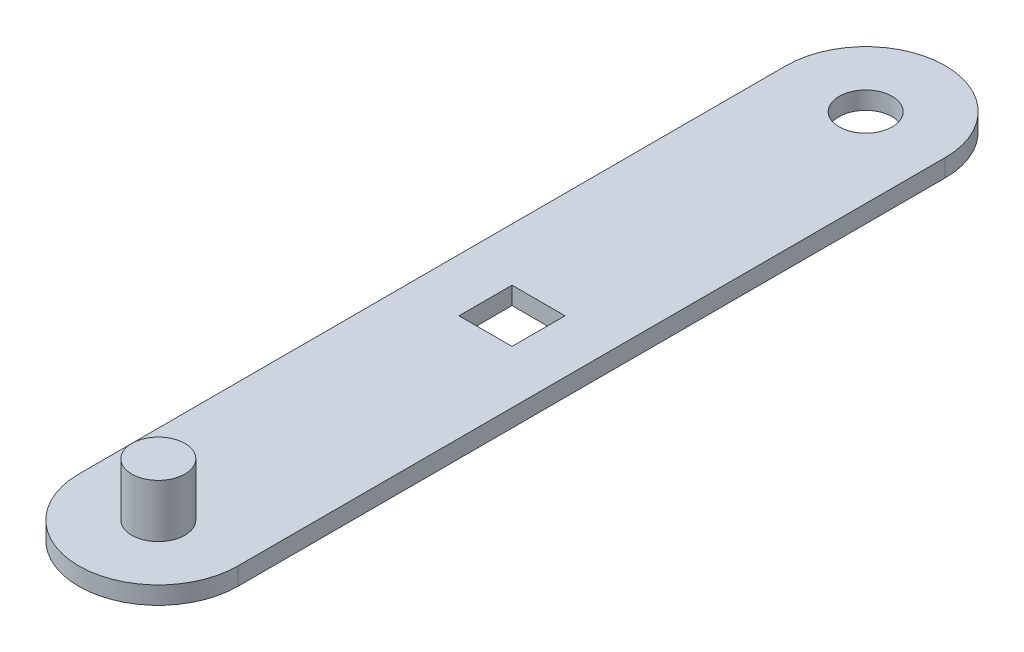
ISO-10303-21;
HEADER;
FILE_DESCRIPTION(('STEP AP214'),'2;1');
FILE_NAME('part.step','',(''),(''),'','','');
FILE_SCHEMA(('AUTOMOTIVE_DESIGN { 1 0 10303 214 1 1 1 1 }'));
ENDSEC;
DATA;
#1=APPLICATION_CONTEXT('core data for automotive mechanical design processes');
#2=APPLICATION_PROTOCOL_DEFINITION('international standard','automotive_design',2000,#1);
#3=PRODUCT_CONTEXT('',#1,'mechanical');
#4=PRODUCT('Part','Part','',(#3));
#5=PRODUCT_RELATED_PRODUCT_CATEGORY('part','',(#4));
#6=PRODUCT_DEFINITION_FORMATION('','',#4);
#7=PRODUCT_DEFINITION_CONTEXT('part definition',#1,'design');
#8=PRODUCT_DEFINITION('design','',#6,#7);
#9=PRODUCT_DEFINITION_SHAPE('','',#8);
#10=(LENGTH_UNIT() NAMED_UNIT(*) SI_UNIT(.MILLI.,.METRE.));
#11=(NAMED_UNIT(*) PLANE_ANGLE_UNIT() SI_UNIT($,.RADIAN.));
#12=(NAMED_UNIT(*) SI_UNIT($,.STERADIAN.) SOLID_ANGLE_UNIT());
#13=UNCERTAINTY_MEASURE_WITH_UNIT(LENGTH_MEASURE(1.E-05),#10,'distance_accuracy_value','');
#14=(GEOMETRIC_REPRESENTATION_CONTEXT(3) GLOBAL_UNCERTAINTY_ASSIGNED_CONTEXT((#13)) GLOBAL_UNIT_ASSIGNED_CONTEXT((#10,
#11,#12)) REPRESENTATION_CONTEXT('',''));
#15=CARTESIAN_POINT('',(0.,0.,0.));
#16=DIRECTION('',(0.,0.,1.));
#17=DIRECTION('',(1.,0.,0.));
#18=AXIS2_PLACEMENT_3D('',#15,#16,#17);
#19=CARTESIAN_POINT('',(-225.,50.,0.));
#20=DIRECTION('',(-1.,0.,0.));
#21=DIRECTION('',(0.,0.,1.));
#22=AXIS2_PLACEMENT_3D('',#19,#20,#21);
#23=PLANE('',#22);
#24=DIRECTION('',(0.,0.,-1.));
#25=VECTOR('',#24,1.);
#26=CARTESIAN_POINT('',(-225.,0.,0.));
#27=LINE('',#26,#25);
#28=CARTESIAN_POINT('',(-225.,0.,1000.));
#29=VERTEX_POINT('',#28);
#30=CARTESIAN_POINT('',(-225.,0.,-1000.));
#31=VERTEX_POINT('',#30);
#32=EDGE_CURVE('E146',#29,#31,#27,.T.);
#33=ORIENTED_EDGE('',*,*,#32,.F.);
#34=DIRECTION('',(0.,-1.,0.));
#35=VECTOR('',#34,1.);
#36=CARTESIAN_POINT('',(-225.,50.,1000.));
#37=LINE('',#36,#35);
#38=CARTESIAN_POINT('',(-225.,50.,1000.));
#39=VERTEX_POINT('',#38);
#40=EDGE_CURVE('E11',#39,#29,#37,.T.);
#41=ORIENTED_EDGE('',*,*,#40,.F.);
#42=DIRECTION('',(0.,0.,-1.));
#43=VECTOR('',#42,1.);
#44=CARTESIAN_POINT('',(-225.,50.,0.));
#45=LINE('',#44,#43);
#46=CARTESIAN_POINT('',(-225.,50.,-1000.));
#47=VERTEX_POINT('',#46);
#48=EDGE_CURVE('E150',#39,#47,#45,.T.);
#49=ORIENTED_EDGE('',*,*,#48,.T.);
#50=DIRECTION('',(0.,-1.,0.));
#51=VECTOR('',#50,1.);
#52=CARTESIAN_POINT('',(-225.,50.,-1000.));
#53=LINE('',#52,#51);
#54=EDGE_CURVE('E161',#47,#31,#53,.T.);
#55=ORIENTED_EDGE('',*,*,#54,.T.);
#56=EDGE_LOOP('',(#33,#41,#49,#55));
#57=FACE_BOUND('',#56,.T.);
#58=ADVANCED_FACE('F40',(#57),#23,.T.);
#59=CARTESIAN_POINT('',(0.,50.,1000.));
#60=DIRECTION('',(0.,-1.,0.));
#61=DIRECTION('',(0.,0.,-1.));
#62=AXIS2_PLACEMENT_3D('',#59,#60,#61);
#63=CYLINDRICAL_SURFACE('',#62,225.);
#64=CARTESIAN_POINT('',(0.,0.,1000.));
#65=DIRECTION('',(0.,1.,0.));
#66=DIRECTION('',(0.,0.,1.));
#67=AXIS2_PLACEMENT_3D('',#64,#65,#66);
#68=CIRCLE('',#67,225.);
#69=CARTESIAN_POINT('',(225.,0.,1000.));
#70=VERTEX_POINT('',#69);
#71=EDGE_CURVE('E164',#70,#29,#68,.F.);
#72=ORIENTED_EDGE('',*,*,#71,.F.);
#73=DIRECTION('',(0.,-1.,0.));
#74=VECTOR('',#73,1.);
#75=CARTESIAN_POINT('',(225.,50.,1000.));
#76=LINE('',#75,#74);
#77=CARTESIAN_POINT('',(225.,50.,1000.));
#78=VERTEX_POINT('',#77);
#79=EDGE_CURVE('E48',#78,#70,#76,.T.);
#80=ORIENTED_EDGE('',*,*,#79,.F.);
#81=CARTESIAN_POINT('',(0.,50.,1000.));
#82=DIRECTION('',(0.,1.,0.));
#83=DIRECTION('',(0.,0.,1.));
#84=AXIS2_PLACEMENT_3D('',#81,#82,#83);
#85=CIRCLE('',#84,225.);
#86=EDGE_CURVE('E153',#78,#39,#85,.F.);
#87=ORIENTED_EDGE('',*,*,#86,.T.);
#88=ORIENTED_EDGE('',*,*,#40,.T.);
#89=EDGE_LOOP('',(#72,#80,#87,#88));
#90=FACE_BOUND('',#89,.T.);
#91=ADVANCED_FACE('F185',(#90),#63,.T.);
#92=CARTESIAN_POINT('',(225.,50.,0.));
#93=DIRECTION('',(-1.,0.,0.));
#94=DIRECTION('',(0.,0.,1.));
#95=AXIS2_PLACEMENT_3D('',#92,#93,#94);
#96=PLANE('',#95);
#97=DIRECTION('',(0.,0.,-1.));
#98=VECTOR('',#97,1.);
#99=CARTESIAN_POINT('',(225.,0.,0.));
#100=LINE('',#99,#98);
#101=CARTESIAN_POINT('',(225.,0.,-1000.));
#102=VERTEX_POINT('',#101);
#103=EDGE_CURVE('E167',#70,#102,#100,.T.);
#104=ORIENTED_EDGE('',*,*,#103,.T.);
#105=DIRECTION('',(0.,-1.,0.));
#106=VECTOR('',#105,1.);
#107=CARTESIAN_POINT('',(225.,50.,-1000.));
#108=LINE('',#107,#106);
#109=CARTESIAN_POINT('',(225.,50.,-1000.));
#110=VERTEX_POINT('',#109);
#111=EDGE_CURVE('E172',#110,#102,#108,.T.);
#112=ORIENTED_EDGE('',*,*,#111,.F.);
#113=DIRECTION('',(0.,0.,-1.));
#114=VECTOR('',#113,1.);
#115=CARTESIAN_POINT('',(225.,50.,0.));
#116=LINE('',#115,#114);
#117=EDGE_CURVE('E157',#78,#110,#116,.T.);
#118=ORIENTED_EDGE('',*,*,#117,.F.);
#119=ORIENTED_EDGE('',*,*,#79,.T.);
#120=EDGE_LOOP('',(#104,#112,#118,#119));
#121=FACE_BOUND('',#120,.T.);
#122=ADVANCED_FACE('F178',(#121),#96,.F.);
#123=CARTESIAN_POINT('',(0.,50.,-1000.));
#124=DIRECTION('',(0.,-1.,0.));
#125=DIRECTION('',(0.,0.,-1.));
#126=AXIS2_PLACEMENT_3D('',#123,#124,#125);
#127=CYLINDRICAL_SURFACE('',#126,225.);
#128=CARTESIAN_POINT('',(0.,0.,-1000.));
#129=DIRECTION('',(0.,1.,0.));
#130=DIRECTION('',(0.,0.,1.));
#131=AXIS2_PLACEMENT_3D('',#128,#129,#130);
#132=CIRCLE('',#131,225.);
#133=EDGE_CURVE('E154',#102,#31,#132,.T.);
#134=ORIENTED_EDGE('',*,*,#133,.T.);
#135=ORIENTED_EDGE('',*,*,#54,.F.);
#136=CARTESIAN_POINT('',(0.,50.,-1000.));
#137=DIRECTION('',(0.,1.,0.));
#138=DIRECTION('',(0.,0.,1.));
#139=AXIS2_PLACEMENT_3D('',#136,#137,#138);
#140=CIRCLE('',#139,225.);
#141=EDGE_CURVE('E159',#110,#47,#140,.T.);
#142=ORIENTED_EDGE('',*,*,#141,.F.);
#143=ORIENTED_EDGE('',*,*,#111,.T.);
#144=EDGE_LOOP('',(#134,#135,#142,#143));
#145=FACE_BOUND('',#144,.T.);
#146=ADVANCED_FACE('F192',(#145),#127,.T.);
#147=CARTESIAN_POINT('',(0.,50.,0.));
#148=DIRECTION('',(0.,1.,0.));
#149=DIRECTION('',(0.,0.,1.));
#150=AXIS2_PLACEMENT_3D('',#147,#148,#149);
#151=PLANE('',#150);
#152=DIRECTION('',(0.,0.,-1.));
#153=VECTOR('',#152,1.);
#154=CARTESIAN_POINT('',(75.,50.,75.));
#155=LINE('',#154,#153);
#156=CARTESIAN_POINT('',(75.,50.,75.));
#157=VERTEX_POINT('',#156);
#158=CARTESIAN_POINT('',(75.,50.,-75.));
#159=VERTEX_POINT('',#158);
#160=EDGE_CURVE('E55',#157,#159,#155,.T.);
#161=ORIENTED_EDGE('',*,*,#160,.F.);
#162=DIRECTION('',(1.,0.,0.));
#163=VECTOR('',#162,1.);
#164=CARTESIAN_POINT('',(-75.,50.,75.));
#165=LINE('',#164,#163);
#166=CARTESIAN_POINT('',(-75.,50.,75.));
#167=VERTEX_POINT('',#166);
#168=EDGE_CURVE('E122',#167,#157,#165,.T.);
#169=ORIENTED_EDGE('',*,*,#168,.F.);
#170=DIRECTION('',(0.,0.,1.));
#171=VECTOR('',#170,1.);
#172=CARTESIAN_POINT('',(-75.,50.,75.));
#173=LINE('',#172,#171);
#174=CARTESIAN_POINT('',(-75.,50.,-75.));
#175=VERTEX_POINT('',#174);
#176=EDGE_CURVE('E125',#175,#167,#173,.T.);
#177=ORIENTED_EDGE('',*,*,#176,.F.);
#178=DIRECTION('',(-1.,0.,0.));
#179=VECTOR('',#178,1.);
#180=CARTESIAN_POINT('',(-75.,50.,-75.));
#181=LINE('',#180,#179);
#182=EDGE_CURVE('E131',#159,#175,#181,.T.);
#183=ORIENTED_EDGE('',*,*,#182,.F.);
#184=EDGE_LOOP('',(#161,#169,#177,#183));
#185=FACE_BOUND('',#184,.T.);
#186=CARTESIAN_POINT('',(0.,50.,-1000.));
#187=DIRECTION('',(0.,1.,0.));
#188=DIRECTION('',(0.,0.,1.));
#189=AXIS2_PLACEMENT_3D('',#186,#187,#188);
#190=CIRCLE('',#189,75.);
#191=CARTESIAN_POINT('',(0.,50.,-925.));
#192=VERTEX_POINT('',#191);
#193=EDGE_CURVE('E137',#192,#192,#190,.T.);
#194=ORIENTED_EDGE('',*,*,#193,.F.);
#195=EDGE_LOOP('',(#194));
#196=FACE_BOUND('',#195,.T.);
#197=CARTESIAN_POINT('',(0.,50.,1000.));
#198=DIRECTION('',(0.,1.,0.));
#199=DIRECTION('',(0.,0.,1.));
#200=AXIS2_PLACEMENT_3D('',#197,#198,#199);
#201=CIRCLE('',#200,75.);
#202=CARTESIAN_POINT('',(0.,50.,1075.));
#203=VERTEX_POINT('',#202);
#204=EDGE_CURVE('E147',#203,#203,#201,.T.);
#205=ORIENTED_EDGE('',*,*,#204,.F.);
#206=EDGE_LOOP('',(#205));
#207=FACE_BOUND('',#206,.T.);
#208=ORIENTED_EDGE('',*,*,#48,.F.);
#209=ORIENTED_EDGE('',*,*,#86,.F.);
#210=ORIENTED_EDGE('',*,*,#117,.T.);
#211=ORIENTED_EDGE('',*,*,#141,.T.);
#212=EDGE_LOOP('',(#208,#209,#210,#211));
#213=FACE_BOUND('',#212,.T.);
#214=ADVANCED_FACE('F194',(#185,#196,#207,#213),#151,.T.);
#215=CARTESIAN_POINT('',(0.,0.,0.));
#216=DIRECTION('',(0.,1.,0.));
#217=DIRECTION('',(0.,0.,1.));
#218=AXIS2_PLACEMENT_3D('',#215,#216,#217);
#219=PLANE('',#218);
#220=DIRECTION('',(1.,0.,0.));
#221=VECTOR('',#220,1.);
#222=CARTESIAN_POINT('',(-75.,0.,75.));
#223=LINE('',#222,#221);
#224=CARTESIAN_POINT('',(-75.,0.,75.));
#225=VERTEX_POINT('',#224);
#226=CARTESIAN_POINT('',(75.,0.,75.));
#227=VERTEX_POINT('',#226);
#228=EDGE_CURVE('E112',#225,#227,#223,.T.);
#229=ORIENTED_EDGE('',*,*,#228,.T.);
#230=DIRECTION('',(0.,0.,-1.));
#231=VECTOR('',#230,1.);
#232=CARTESIAN_POINT('',(75.,0.,75.));
#233=LINE('',#232,#231);
#234=CARTESIAN_POINT('',(75.,0.,-75.));
#235=VERTEX_POINT('',#234);
#236=EDGE_CURVE('E106',#227,#235,#233,.T.);
#237=ORIENTED_EDGE('',*,*,#236,.T.);
#238=DIRECTION('',(-1.,0.,0.));
#239=VECTOR('',#238,1.);
#240=CARTESIAN_POINT('',(-75.,0.,-75.));
#241=LINE('',#240,#239);
#242=CARTESIAN_POINT('',(-75.,0.,-75.));
#243=VERTEX_POINT('',#242);
#244=EDGE_CURVE('E115',#235,#243,#241,.T.);
#245=ORIENTED_EDGE('',*,*,#244,.T.);
#246=DIRECTION('',(0.,0.,1.));
#247=VECTOR('',#246,1.);
#248=CARTESIAN_POINT('',(-75.,0.,75.));
#249=LINE('',#248,#247);
#250=EDGE_CURVE('E63',#243,#225,#249,.T.);
#251=ORIENTED_EDGE('',*,*,#250,.T.);
#252=EDGE_LOOP('',(#229,#237,#245,#251));
#253=FACE_BOUND('',#252,.T.);
#254=CARTESIAN_POINT('',(0.,0.,-1000.));
#255=DIRECTION('',(0.,1.,0.));
#256=DIRECTION('',(0.,0.,1.));
#257=AXIS2_PLACEMENT_3D('',#254,#255,#256);
#258=CIRCLE('',#257,75.);
#259=CARTESIAN_POINT('',(0.,0.,-925.));
#260=VERTEX_POINT('',#259);
#261=EDGE_CURVE('E43',#260,#260,#258,.T.);
#262=ORIENTED_EDGE('',*,*,#261,.T.);
#263=EDGE_LOOP('',(#262));
#264=FACE_BOUND('',#263,.T.);
#265=ORIENTED_EDGE('',*,*,#32,.T.);
#266=ORIENTED_EDGE('',*,*,#133,.F.);
#267=ORIENTED_EDGE('',*,*,#103,.F.);
#268=ORIENTED_EDGE('',*,*,#71,.T.);
#269=EDGE_LOOP('',(#265,#266,#267,#268));
#270=FACE_BOUND('',#269,.T.);
#271=ADVANCED_FACE('F119',(#253,#264,#270),#219,.F.);
#272=CARTESIAN_POINT('',(0.,200.,1000.));
#273=DIRECTION('',(0.,-1.,0.));
#274=DIRECTION('',(0.,0.,-1.));
#275=AXIS2_PLACEMENT_3D('',#272,#273,#274);
#276=CYLINDRICAL_SURFACE('',#275,75.);
#277=CARTESIAN_POINT('',(0.,200.,1000.));
#278=DIRECTION('',(0.,1.,0.));
#279=DIRECTION('',(0.,0.,1.));
#280=AXIS2_PLACEMENT_3D('',#277,#278,#279);
#281=CIRCLE('',#280,75.);
#282=CARTESIAN_POINT('',(0.,200.,1075.));
#283=VERTEX_POINT('',#282);
#284=EDGE_CURVE('E143',#283,#283,#281,.T.);
#285=ORIENTED_EDGE('',*,*,#284,.F.);
#286=EDGE_LOOP('',(#285));
#287=FACE_BOUND('',#286,.T.);
#288=ORIENTED_EDGE('',*,*,#204,.T.);
#289=EDGE_LOOP('',(#288));
#290=FACE_BOUND('',#289,.T.);
#291=ADVANCED_FACE('F202',(#287,#290),#276,.T.);
#292=CARTESIAN_POINT('',(0.,200.,0.));
#293=DIRECTION('',(0.,1.,0.));
#294=DIRECTION('',(0.,0.,1.));
#295=AXIS2_PLACEMENT_3D('',#292,#293,#294);
#296=PLANE('',#295);
#297=ORIENTED_EDGE('',*,*,#284,.T.);
#298=EDGE_LOOP('',(#297));
#299=FACE_BOUND('',#298,.T.);
#300=ADVANCED_FACE('F243',(#299),#296,.T.);
#301=CARTESIAN_POINT('',(0.,-200.,-1000.));
#302=DIRECTION('',(0.,1.,0.));
#303=DIRECTION('',(0.,0.,1.));
#304=AXIS2_PLACEMENT_3D('',#301,#302,#303);
#305=CYLINDRICAL_SURFACE('',#304,75.);
#306=ORIENTED_EDGE('',*,*,#193,.T.);
#307=EDGE_LOOP('',(#306));
#308=FACE_BOUND('',#307,.T.);
#309=ORIENTED_EDGE('',*,*,#261,.F.);
#310=EDGE_LOOP('',(#309));
#311=FACE_BOUND('',#310,.T.);
#312=ADVANCED_FACE('F249',(#308,#311),#305,.F.);
#313=CARTESIAN_POINT('',(75.,0.,75.));
#314=DIRECTION('',(1.,0.,0.));
#315=DIRECTION('',(0.,0.,-1.));
#316=AXIS2_PLACEMENT_3D('',#313,#314,#315);
#317=PLANE('',#316);
#318=ORIENTED_EDGE('',*,*,#160,.T.);
#319=DIRECTION('',(0.,1.,0.));
#320=VECTOR('',#319,1.);
#321=CARTESIAN_POINT('',(75.,0.,-75.));
#322=LINE('',#321,#320);
#323=EDGE_CURVE('E102',#235,#159,#322,.T.);
#324=ORIENTED_EDGE('',*,*,#323,.F.);
#325=ORIENTED_EDGE('',*,*,#236,.F.);
#326=DIRECTION('',(0.,1.,0.));
#327=VECTOR('',#326,1.);
#328=CARTESIAN_POINT('',(75.,0.,75.));
#329=LINE('',#328,#327);
#330=EDGE_CURVE('E135',#227,#157,#329,.T.);
#331=ORIENTED_EDGE('',*,*,#330,.T.);
#332=EDGE_LOOP('',(#318,#324,#325,#331));
#333=FACE_BOUND('',#332,.T.);
#334=ADVANCED_FACE('F104',(#333),#317,.F.);
#335=CARTESIAN_POINT('',(-75.,0.,75.));
#336=DIRECTION('',(0.,0.,1.));
#337=DIRECTION('',(1.,0.,0.));
#338=AXIS2_PLACEMENT_3D('',#335,#336,#337);
#339=PLANE('',#338);
#340=ORIENTED_EDGE('',*,*,#168,.T.);
#341=ORIENTED_EDGE('',*,*,#330,.F.);
#342=ORIENTED_EDGE('',*,*,#228,.F.);
#343=DIRECTION('',(0.,1.,0.));
#344=VECTOR('',#343,1.);
#345=CARTESIAN_POINT('',(-75.,0.,75.));
#346=LINE('',#345,#344);
#347=EDGE_CURVE('E138',#225,#167,#346,.T.);
#348=ORIENTED_EDGE('',*,*,#347,.T.);
#349=EDGE_LOOP('',(#340,#341,#342,#348));
#350=FACE_BOUND('',#349,.T.);
#351=ADVANCED_FACE('F262',(#350),#339,.F.);
#352=CARTESIAN_POINT('',(-75.,0.,75.));
#353=DIRECTION('',(-1.,0.,0.));
#354=DIRECTION('',(0.,0.,1.));
#355=AXIS2_PLACEMENT_3D('',#352,#353,#354);
#356=PLANE('',#355);
#357=ORIENTED_EDGE('',*,*,#176,.T.);
#358=ORIENTED_EDGE('',*,*,#347,.F.);
#359=ORIENTED_EDGE('',*,*,#250,.F.);
#360=DIRECTION('',(0.,1.,0.));
#361=VECTOR('',#360,1.);
#362=CARTESIAN_POINT('',(-75.,0.,-75.));
#363=LINE('',#362,#361);
#364=EDGE_CURVE('E111',#243,#175,#363,.T.);
#365=ORIENTED_EDGE('',*,*,#364,.T.);
#366=EDGE_LOOP('',(#357,#358,#359,#365));
#367=FACE_BOUND('',#366,.T.);
#368=ADVANCED_FACE('F269',(#367),#356,.F.);
#369=CARTESIAN_POINT('',(-75.,0.,-75.));
#370=DIRECTION('',(0.,0.,-1.));
#371=DIRECTION('',(-1.,0.,0.));
#372=AXIS2_PLACEMENT_3D('',#369,#370,#371);
#373=PLANE('',#372);
#374=ORIENTED_EDGE('',*,*,#182,.T.);
#375=ORIENTED_EDGE('',*,*,#364,.F.);
#376=ORIENTED_EDGE('',*,*,#244,.F.);
#377=ORIENTED_EDGE('',*,*,#323,.T.);
#378=EDGE_LOOP('',(#374,#375,#376,#377));
#379=FACE_BOUND('',#378,.T.);
#380=ADVANCED_FACE('F116',(#379),#373,.F.);
#381=CLOSED_SHELL('',(#58,#91,#122,#146,#214,#271,#291,#300,#312,#334,#351,#368,#380));
#382=MANIFOLD_SOLID_BREP('B2',#381);
#383=ADVANCED_BREP_SHAPE_REPRESENTATION('',(#18,#382),#14);
#384=SHAPE_DEFINITION_REPRESENTATION(#9,#383);
ENDSEC;
END-ISO-10303-21;
